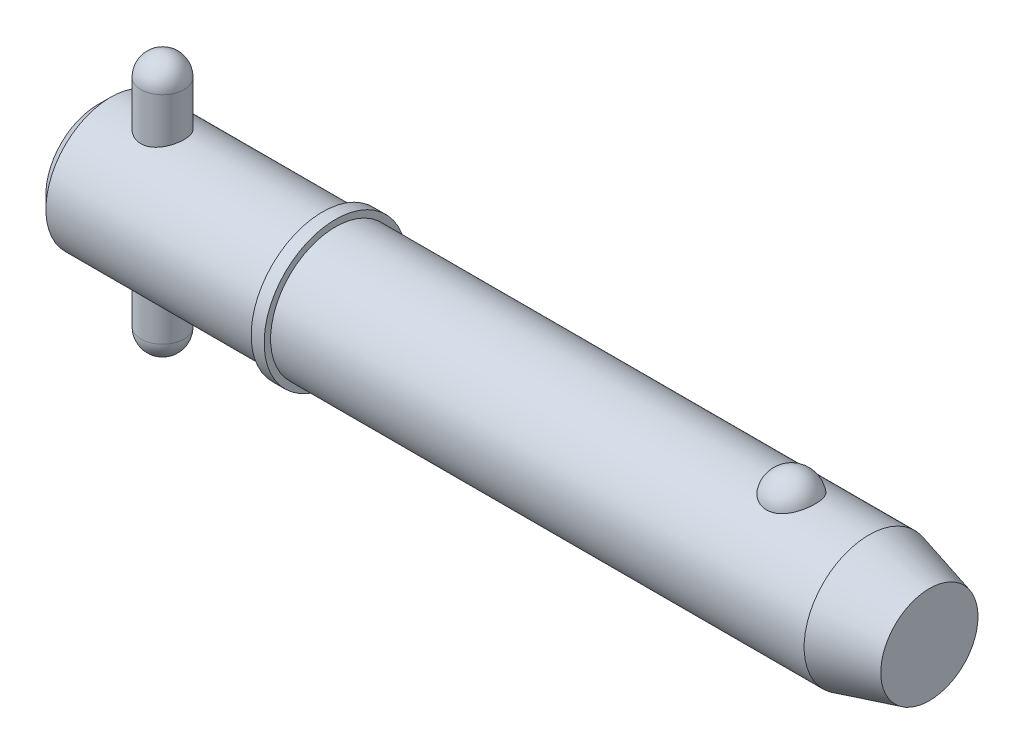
ISO-10303-21;
HEADER;
FILE_DESCRIPTION(('STEP AP214'),'2;1');
FILE_NAME('part.step','',(''),(''),'','','');
FILE_SCHEMA(('AUTOMOTIVE_DESIGN { 1 0 10303 214 1 1 1 1 }'));
ENDSEC;
DATA;
#1=APPLICATION_CONTEXT('core data for automotive mechanical design processes');
#2=APPLICATION_PROTOCOL_DEFINITION('international standard','automotive_design',2000,#1);
#3=PRODUCT_CONTEXT('',#1,'mechanical');
#4=PRODUCT('Part','Part','',(#3));
#5=PRODUCT_RELATED_PRODUCT_CATEGORY('part','',(#4));
#6=PRODUCT_DEFINITION_FORMATION('','',#4);
#7=PRODUCT_DEFINITION_CONTEXT('part definition',#1,'design');
#8=PRODUCT_DEFINITION('design','',#6,#7);
#9=PRODUCT_DEFINITION_SHAPE('','',#8);
#10=(LENGTH_UNIT() NAMED_UNIT(*) SI_UNIT(.MILLI.,.METRE.));
#11=(NAMED_UNIT(*) PLANE_ANGLE_UNIT() SI_UNIT($,.RADIAN.));
#12=(NAMED_UNIT(*) SI_UNIT($,.STERADIAN.) SOLID_ANGLE_UNIT());
#13=UNCERTAINTY_MEASURE_WITH_UNIT(LENGTH_MEASURE(1.E-05),#10,'distance_accuracy_value','');
#14=(GEOMETRIC_REPRESENTATION_CONTEXT(3) GLOBAL_UNCERTAINTY_ASSIGNED_CONTEXT((#13)) GLOBAL_UNIT_ASSIGNED_CONTEXT((#10,
#11,#12)) REPRESENTATION_CONTEXT('',''));
#15=CARTESIAN_POINT('',(0.,0.,0.));
#16=DIRECTION('',(0.,0.,1.));
#17=DIRECTION('',(1.,0.,0.));
#18=AXIS2_PLACEMENT_3D('',#15,#16,#17);
#19=CARTESIAN_POINT('',(9.525,19.05,0.));
#20=DIRECTION('',(0.,-1.,0.));
#21=DIRECTION('',(0.,0.,-1.));
#22=AXIS2_PLACEMENT_3D('',#19,#20,#21);
#23=CYLINDRICAL_SURFACE('',#22,3.175);
#24=CARTESIAN_POINT('',(9.525,-15.875,0.));
#25=DIRECTION('',(0.,-1.,0.));
#26=DIRECTION('',(0.,0.,-1.));
#27=AXIS2_PLACEMENT_3D('',#24,#25,#26);
#28=CIRCLE('',#27,3.175);
#29=CARTESIAN_POINT('',(9.525,-15.875,-3.175));
#30=VERTEX_POINT('',#29);
#31=EDGE_CURVE('P0_E10',#30,#30,#28,.F.);
#32=CARTESIAN_POINT('',(9.525,15.875,0.));
#33=DIRECTION('',(0.,-1.,0.));
#34=DIRECTION('',(0.,0.,-1.));
#35=AXIS2_PLACEMENT_3D('',#32,#33,#34);
#36=CIRCLE('',#35,3.175);
#37=CARTESIAN_POINT('',(9.525,15.875,-3.175));
#38=VERTEX_POINT('',#37);
#39=EDGE_CURVE('P0_E21',#38,#38,#36,.T.);
#40=CARTESIAN_POINT('',(9.525,-15.875,-3.175));
#41=CARTESIAN_POINT('',(9.525,-15.5442708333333,-3.175));
#42=CARTESIAN_POINT('',(9.525,-15.2135416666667,-3.175));
#43=CARTESIAN_POINT('',(9.525,-14.5520833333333,-3.175));
#44=CARTESIAN_POINT('',(9.525,-14.2213541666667,-3.175));
#45=CARTESIAN_POINT('',(9.525,-13.5598958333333,-3.175));
#46=CARTESIAN_POINT('',(9.525,-13.2291666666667,-3.175));
#47=CARTESIAN_POINT('',(9.525,-12.5677083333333,-3.175));
#48=CARTESIAN_POINT('',(9.525,-12.2369791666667,-3.175));
#49=CARTESIAN_POINT('',(9.525,-11.5755208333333,-3.175));
#50=CARTESIAN_POINT('',(9.525,-11.2447916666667,-3.175));
#51=CARTESIAN_POINT('',(9.525,-10.5833333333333,-3.175));
#52=CARTESIAN_POINT('',(9.525,-10.2526041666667,-3.175));
#53=CARTESIAN_POINT('',(9.525,-9.59114583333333,-3.175));
#54=CARTESIAN_POINT('',(9.525,-9.26041666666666,-3.175));
#55=CARTESIAN_POINT('',(9.525,-8.59895833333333,-3.175));
#56=CARTESIAN_POINT('',(9.525,-8.26822916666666,-3.175));
#57=CARTESIAN_POINT('',(9.525,-7.60677083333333,-3.175));
#58=CARTESIAN_POINT('',(9.525,-7.27604166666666,-3.175));
#59=CARTESIAN_POINT('',(9.525,-6.61458333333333,-3.175));
#60=CARTESIAN_POINT('',(9.525,-6.28385416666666,-3.175));
#61=CARTESIAN_POINT('',(9.525,-5.62239583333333,-3.175));
#62=CARTESIAN_POINT('',(9.525,-5.29166666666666,-3.175));
#63=CARTESIAN_POINT('',(9.525,-4.63020833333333,-3.175));
#64=CARTESIAN_POINT('',(9.525,-4.29947916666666,-3.175));
#65=CARTESIAN_POINT('',(9.525,-3.63802083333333,-3.175));
#66=CARTESIAN_POINT('',(9.525,-3.30729166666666,-3.175));
#67=CARTESIAN_POINT('',(9.525,-2.64583333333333,-3.175));
#68=CARTESIAN_POINT('',(9.525,-2.31510416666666,-3.175));
#69=CARTESIAN_POINT('',(9.525,-1.65364583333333,-3.175));
#70=CARTESIAN_POINT('',(9.525,-1.32291666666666,-3.175));
#71=CARTESIAN_POINT('',(9.525,-0.661458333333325,-3.175));
#72=CARTESIAN_POINT('',(9.525,-0.330729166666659,-3.175));
#73=CARTESIAN_POINT('',(9.525,0.330729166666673,-3.175));
#74=CARTESIAN_POINT('',(9.525,0.661458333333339,-3.175));
#75=CARTESIAN_POINT('',(9.525,1.32291666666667,-3.175));
#76=CARTESIAN_POINT('',(9.525,1.65364583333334,-3.175));
#77=CARTESIAN_POINT('',(9.525,2.31510416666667,-3.175));
#78=CARTESIAN_POINT('',(9.525,2.64583333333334,-3.175));
#79=CARTESIAN_POINT('',(9.525,3.30729166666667,-3.175));
#80=CARTESIAN_POINT('',(9.525,3.63802083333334,-3.175));
#81=CARTESIAN_POINT('',(9.525,4.29947916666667,-3.175));
#82=CARTESIAN_POINT('',(9.525,4.63020833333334,-3.175));
#83=CARTESIAN_POINT('',(9.525,5.29166666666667,-3.175));
#84=CARTESIAN_POINT('',(9.525,5.62239583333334,-3.175));
#85=CARTESIAN_POINT('',(9.525,6.28385416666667,-3.175));
#86=CARTESIAN_POINT('',(9.525,6.61458333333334,-3.175));
#87=CARTESIAN_POINT('',(9.525,7.27604166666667,-3.175));
#88=CARTESIAN_POINT('',(9.525,7.60677083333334,-3.175));
#89=CARTESIAN_POINT('',(9.525,8.26822916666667,-3.175));
#90=CARTESIAN_POINT('',(9.525,8.59895833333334,-3.175));
#91=CARTESIAN_POINT('',(9.525,9.26041666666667,-3.175));
#92=CARTESIAN_POINT('',(9.525,9.59114583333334,-3.175));
#93=CARTESIAN_POINT('',(9.525,10.2526041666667,-3.175));
#94=CARTESIAN_POINT('',(9.525,10.5833333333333,-3.175));
#95=CARTESIAN_POINT('',(9.525,11.2447916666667,-3.175));
#96=CARTESIAN_POINT('',(9.525,11.5755208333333,-3.175));
#97=CARTESIAN_POINT('',(9.525,12.2369791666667,-3.175));
#98=CARTESIAN_POINT('',(9.525,12.5677083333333,-3.175));
#99=CARTESIAN_POINT('',(9.525,13.2291666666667,-3.175));
#100=CARTESIAN_POINT('',(9.525,13.5598958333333,-3.175));
#101=CARTESIAN_POINT('',(9.525,14.2213541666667,-3.175));
#102=CARTESIAN_POINT('',(9.525,14.5520833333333,-3.175));
#103=CARTESIAN_POINT('',(9.525,15.2135416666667,-3.175));
#104=CARTESIAN_POINT('',(9.525,15.5442708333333,-3.175));
#105=CARTESIAN_POINT('',(9.525,15.875,-3.175));
#106=B_SPLINE_CURVE_WITH_KNOTS('',3,(#40,#41,#42,#43,#44,#45,#46,#47,#48,#49,#50,#51,#52,#53,
#54,#55,#56,#57,#58,#59,#60,#61,#62,#63,#64,#65,#66,#67,#68,#69,#70,#71,#72,#73,#74,#75,#76,#77,
#78,#79,#80,#81,#82,#83,#84,#85,#86,#87,#88,#89,#90,#91,#92,#93,#94,#95,#96,#97,#98,#99,#100,
#101,#102,#103,#104,#105),.UNSPECIFIED.,.F.,.F.,(4,2,2,2,2,2,2,2,2,2,2,2,2,2,2,2,2,2,2,2,2,2,2,
2,2,2,2,2,2,2,2,2,4),(0.,0.992187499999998,1.984375,2.9765625,3.96875,4.96093749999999,5.953125,
6.9453125,7.9375,8.92968749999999,9.921875,10.9140625,11.90625,12.8984375,13.890625,14.8828125,
15.875,16.8671875,17.859375,18.8515625,19.84375,20.8359375,21.828125,22.8203125,23.8125,
24.8046875,25.796875,26.7890625,27.78125,28.7734375,29.765625,30.7578125,31.75),.UNSPECIFIED.);
#107=EDGE_CURVE('P0_BSEAM14',#30,#38,#106,.T.);
#108=ORIENTED_EDGE('',*,*,#31,.T.);
#109=ORIENTED_EDGE('',*,*,#39,.T.);
#110=ORIENTED_EDGE('',*,*,#107,.T.);
#111=ORIENTED_EDGE('',*,*,#107,.F.);
#112=EDGE_LOOP('',(#108,#110,#109,#111));
#113=FACE_BOUND('',#112,.T.);
#114=ADVANCED_FACE('P0_F14',(#113),#23,.T.);
#115=CARTESIAN_POINT('',(9.525,-15.875,0.));
#116=DIRECTION('',(0.,0.,1.));
#117=DIRECTION('',(1.,0.,0.));
#118=AXIS2_PLACEMENT_3D('',#115,#116,#117);
#119=SPHERICAL_SURFACE('',#118,3.175);
#120=CARTESIAN_POINT('',(9.525,-15.875,0.));
#121=DIRECTION('',(0.,-1.,0.));
#122=DIRECTION('',(0.,0.,-1.));
#123=AXIS2_PLACEMENT_3D('',#120,#121,#122);
#124=SPHERICAL_SURFACE('',#123,3.175);
#125=ORIENTED_EDGE('',*,*,#31,.F.);
#126=EDGE_LOOP('',(#125));
#127=FACE_BOUND('',#126,.T.);
#128=ADVANCED_FACE('P0_F29',(#127),#124,.T.);
#129=CARTESIAN_POINT('',(9.525,15.875,0.));
#130=DIRECTION('',(0.,0.,1.));
#131=DIRECTION('',(1.,0.,0.));
#132=AXIS2_PLACEMENT_3D('',#129,#130,#131);
#133=SPHERICAL_SURFACE('',#132,3.175);
#134=CARTESIAN_POINT('',(9.525,15.875,0.));
#135=DIRECTION('',(0.,-1.,0.));
#136=DIRECTION('',(0.,0.,-1.));
#137=AXIS2_PLACEMENT_3D('',#134,#135,#136);
#138=SPHERICAL_SURFACE('',#137,3.175);
#139=ORIENTED_EDGE('',*,*,#39,.F.);
#140=EDGE_LOOP('',(#139));
#141=FACE_BOUND('',#140,.T.);
#142=ADVANCED_FACE('P0_F16',(#141),#138,.T.);
#143=CLOSED_SHELL('',(#114,#128,#142));
#144=MANIFOLD_SOLID_BREP('P0_B1',#143);
#145=CARTESIAN_POINT('',(0.,0.,0.));
#146=DIRECTION('',(1.,0.,0.));
#147=DIRECTION('',(0.,0.,-1.));
#148=AXIS2_PLACEMENT_3D('',#145,#146,#147);
#149=CYLINDRICAL_SURFACE('',#148,9.525);
#150=CARTESIAN_POINT('',(113.343054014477,0.,0.));
#151=DIRECTION('',(1.,0.,0.));
#152=DIRECTION('',(0.,0.,-1.));
#153=AXIS2_PLACEMENT_3D('',#150,#151,#152);
#154=CIRCLE('',#153,9.525);
#155=CARTESIAN_POINT('',(113.343054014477,0.,-9.525));
#156=VERTEX_POINT('',#155);
#157=EDGE_CURVE('P1_E81',#156,#156,#154,.T.);
#158=ORIENTED_EDGE('',*,*,#157,.F.);
#159=EDGE_LOOP('',(#158));
#160=FACE_BOUND('',#159,.T.);
#161=CARTESIAN_POINT('',(34.93,0.,0.));
#162=DIRECTION('',(1.,0.,0.));
#163=DIRECTION('',(0.,0.,-1.));
#164=AXIS2_PLACEMENT_3D('',#161,#162,#163);
#165=CIRCLE('',#164,9.525);
#166=CARTESIAN_POINT('',(34.93,0.,-9.525));
#167=VERTEX_POINT('',#166);
#168=EDGE_CURVE('P1_E85',#167,#167,#165,.T.);
#169=ORIENTED_EDGE('',*,*,#168,.T.);
#170=EDGE_LOOP('',(#169));
#171=FACE_BOUND('',#170,.T.);
#172=CARTESIAN_POINT('',(101.945757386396,8.80405803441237,3.63513233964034));
#173=CARTESIAN_POINT('',(101.851676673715,8.80405953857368,3.63513053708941));
#174=CARTESIAN_POINT('',(101.757561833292,8.80561325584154,3.63137461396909));
#175=CARTESIAN_POINT('',(101.570012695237,8.81177748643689,3.61638665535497));
#176=CARTESIAN_POINT('',(101.476578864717,8.81638992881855,3.60514990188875));
#177=CARTESIAN_POINT('',(101.197945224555,8.83467114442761,3.56024627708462));
#178=CARTESIAN_POINT('',(101.014691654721,8.85278327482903,3.5153862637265));
#179=CARTESIAN_POINT('',(100.659509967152,8.89871214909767,3.39742145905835));
#180=CARTESIAN_POINT('',(100.487553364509,8.92650327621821,3.32439116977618));
#181=CARTESIAN_POINT('',(100.158707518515,8.98874819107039,3.15220244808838));
#182=CARTESIAN_POINT('',(100.001811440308,9.02319893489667,3.05305594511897));
#183=CARTESIAN_POINT('',(99.7022147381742,9.09629186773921,2.82797815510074));
#184=CARTESIAN_POINT('',(99.5600600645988,9.13502685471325,2.70135138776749));
#185=CARTESIAN_POINT('',(99.2982999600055,9.2118657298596,2.42641932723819));
#186=CARTESIAN_POINT('',(99.1787015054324,9.2499694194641,2.27810735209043));
#187=CARTESIAN_POINT('',(98.959645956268,9.32341082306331,1.95652290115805));
#188=CARTESIAN_POINT('',(98.8613174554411,9.35855090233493,1.78243511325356));
#189=CARTESIAN_POINT('',(98.6938190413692,9.42045142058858,1.41937246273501));
#190=CARTESIAN_POINT('',(98.6246511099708,9.44721128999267,1.23039658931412));
#191=CARTESIAN_POINT('',(98.5161994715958,9.48990641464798,0.84037088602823));
#192=CARTESIAN_POINT('',(98.4772880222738,9.50570658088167,0.639202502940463));
#193=CARTESIAN_POINT('',(98.4315550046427,9.52433146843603,0.23266436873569));
#194=CARTESIAN_POINT('',(98.4247324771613,9.52715657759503,0.0272947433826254));
#195=CARTESIAN_POINT('',(98.443255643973,9.51956918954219,-0.380478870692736));
#196=CARTESIAN_POINT('',(98.4684052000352,9.50923740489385,-0.582893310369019));
#197=CARTESIAN_POINT('',(98.5500253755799,9.47651897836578,-0.980293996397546));
#198=CARTESIAN_POINT('',(98.6064966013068,9.45413210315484,-1.17528009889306));
#199=CARTESIAN_POINT('',(98.7497192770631,9.39954044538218,-1.55263697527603));
#200=CARTESIAN_POINT('',(98.8365124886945,9.36732213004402,-1.73498993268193));
#201=CARTESIAN_POINT('',(99.0386103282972,9.29640700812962,-2.08177763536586));
#202=CARTESIAN_POINT('',(99.1539172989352,9.25770966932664,-2.24621090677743));
#203=CARTESIAN_POINT('',(99.411264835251,9.17775604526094,-2.55338333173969));
#204=CARTESIAN_POINT('',(99.5534344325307,9.136488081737,-2.69601150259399));
#205=CARTESIAN_POINT('',(99.86089985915,9.05620497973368,-2.95451229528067));
#206=CARTESIAN_POINT('',(100.026193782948,9.01718965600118,-3.070387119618));
#207=CARTESIAN_POINT('',(100.372052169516,8.94680019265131,-3.26976836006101));
#208=CARTESIAN_POINT('',(100.552227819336,8.91528408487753,-3.353897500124));
#209=CARTESIAN_POINT('',(100.925651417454,8.86272514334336,-3.49043503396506));
#210=CARTESIAN_POINT('',(101.118894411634,8.84167836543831,-3.54285537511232));
#211=CARTESIAN_POINT('',(101.502503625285,8.81348056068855,-3.61241306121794));
#212=CARTESIAN_POINT('',(101.692525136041,8.80568348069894,-3.6311933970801));
#213=CARTESIAN_POINT('',(102.073190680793,8.80289410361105,-3.63795342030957));
#214=CARTESIAN_POINT('',(102.263834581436,8.80789922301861,-3.62593932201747));
#215=CARTESIAN_POINT('',(102.634007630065,8.82974915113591,-3.57238430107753));
#216=CARTESIAN_POINT('',(102.813697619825,8.84621463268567,-3.53178890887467));
#217=CARTESIAN_POINT('',(103.163422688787,8.88875330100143,-3.42331083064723));
#218=CARTESIAN_POINT('',(103.333456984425,8.91482726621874,-3.35542593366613));
#219=CARTESIAN_POINT('',(103.663237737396,8.97448239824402,-3.19248225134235));
#220=CARTESIAN_POINT('',(103.822680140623,9.00821446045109,-3.0968647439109));
#221=CARTESIAN_POINT('',(104.123513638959,9.07935398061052,-2.88162736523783));
#222=CARTESIAN_POINT('',(104.264900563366,9.11676228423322,-2.76200196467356));
#223=CARTESIAN_POINT('',(104.53331931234,9.19347419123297,-2.49516285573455));
#224=CARTESIAN_POINT('',(104.659275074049,9.23277872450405,-2.34686614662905));
#225=CARTESIAN_POINT('',(104.885522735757,9.3073761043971,-2.0309368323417));
#226=CARTESIAN_POINT('',(104.98581004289,9.34266823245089,-1.86330077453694));
#227=CARTESIAN_POINT('',(105.161514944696,9.40674710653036,-1.50744893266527));
#228=CARTESIAN_POINT('',(105.236041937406,9.43529176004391,-1.31874876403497));
#229=CARTESIAN_POINT('',(105.35416505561,9.48144132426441,-0.930631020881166));
#230=CARTESIAN_POINT('',(105.397760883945,9.49904612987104,-0.73121334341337));
#231=CARTESIAN_POINT('',(105.453158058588,9.5215314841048,-0.327147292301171));
#232=CARTESIAN_POINT('',(105.464935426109,9.52640243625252,-0.12249509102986));
#233=CARTESIAN_POINT('',(105.456382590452,9.5228957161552,0.286018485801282));
#234=CARTESIAN_POINT('',(105.43605305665,9.5145183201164,0.489879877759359));
#235=CARTESIAN_POINT('',(105.363884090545,9.48544083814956,0.889994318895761));
#236=CARTESIAN_POINT('',(105.312199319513,9.46480124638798,1.08627971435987));
#237=CARTESIAN_POINT('',(105.178491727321,9.41333895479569,1.46682086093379));
#238=CARTESIAN_POINT('',(105.096466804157,9.38251554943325,1.65107577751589));
#239=CARTESIAN_POINT('',(104.90319292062,9.31365636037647,2.00346348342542));
#240=CARTESIAN_POINT('',(104.791783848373,9.27558138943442,2.17150083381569));
#241=CARTESIAN_POINT('',(104.542294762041,9.19638714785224,2.48563115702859));
#242=CARTESIAN_POINT('',(104.404216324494,9.15526805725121,2.63172542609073));
#243=CARTESIAN_POINT('',(104.104843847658,9.07465393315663,2.89750997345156));
#244=CARTESIAN_POINT('',(103.943610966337,9.03515496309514,3.01726776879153));
#245=CARTESIAN_POINT('',(103.601613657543,8.96227564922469,3.22732920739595));
#246=CARTESIAN_POINT('',(103.420841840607,8.92889763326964,3.31762165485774));
#247=CARTESIAN_POINT('',(103.051445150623,8.8734538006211,3.46314419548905));
#248=CARTESIAN_POINT('',(102.86332371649,8.85102983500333,3.51950082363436));
#249=CARTESIAN_POINT('',(102.57578699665,8.8266696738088,3.57993683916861));
#250=CARTESIAN_POINT('',(102.479133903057,8.82009725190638,3.5960621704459));
#251=CARTESIAN_POINT('',(102.284677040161,8.81020897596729,3.62022512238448));
#252=CARTESIAN_POINT('',(102.18687410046,8.80689090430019,3.62826825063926));
#253=CARTESIAN_POINT('',(102.041224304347,8.80445615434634,3.63416760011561));
#254=CARTESIAN_POINT('',(101.993495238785,8.80405727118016,3.63513325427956));
#255=CARTESIAN_POINT('',(101.945757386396,8.80405803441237,3.63513233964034));
#256=B_SPLINE_CURVE_WITH_KNOTS('',3,(#172,#173,#174,#175,#176,#177,#178,#179,#180,#181,#182,
#183,#184,#185,#186,#187,#188,#189,#190,#191,#192,#193,#194,#195,#196,#197,#198,#199,#200,#201,
#202,#203,#204,#205,#206,#207,#208,#209,#210,#211,#212,#213,#214,#215,#216,#217,#218,#219,#220,
#221,#222,#223,#224,#225,#226,#227,#228,#229,#230,#231,#232,#233,#234,#235,#236,#237,#238,#239,
#240,#241,#242,#243,#244,#245,#246,#247,#248,#249,#250,#251,#252,#253,#254,#255),.UNSPECIFIED.,
.T.,.F.,(4,2,2,2,2,2,2,2,2,2,2,2,2,2,2,2,2,2,2,2,2,2,2,2,2,2,2,2,2,2,2,2,2,2,2,2,2,2,2,2,2,4),
(0.,0.282202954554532,0.564584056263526,1.13017050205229,1.69427128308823,2.25811483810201,
2.83836627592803,3.4187968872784,4.02497117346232,4.63118665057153,5.24474754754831,
5.85829010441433,6.46808687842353,7.07789545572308,7.68854723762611,8.29924920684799,
8.91296283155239,9.52662591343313,10.1275338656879,10.7282152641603,11.2986646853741,
11.8689989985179,12.4213015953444,12.973648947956,13.5380053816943,14.1024919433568,
14.695298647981,15.2882113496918,15.8999469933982,16.5116885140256,17.1238909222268,
17.7360805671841,18.3452748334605,18.9545113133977,19.567138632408,20.179729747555,
20.7907316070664,21.4019653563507,21.9915938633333,22.2859053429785,22.5800161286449,
22.7232098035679),.UNSPECIFIED.);
#257=CARTESIAN_POINT('',(101.945757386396,8.80405803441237,3.63513233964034));
#258=VERTEX_POINT('',#257);
#259=EDGE_CURVE('P1_E35',#258,#258,#256,.T.);
#260=ORIENTED_EDGE('',*,*,#259,.T.);
#261=EDGE_LOOP('',(#260));
#262=FACE_BOUND('',#261,.T.);
#263=ADVANCED_FACE('P1_F13',(#160,#171,#262),#149,.T.);
#264=CARTESIAN_POINT('',(0.,0.,0.));
#265=DIRECTION('',(-1.,0.,0.));
#266=DIRECTION('',(0.,0.,1.));
#267=AXIS2_PLACEMENT_3D('',#264,#265,#266);
#268=PLANE('',#267);
#269=CARTESIAN_POINT('',(0.,0.,0.));
#270=DIRECTION('',(1.,0.,0.));
#271=DIRECTION('',(0.,0.,-1.));
#272=AXIS2_PLACEMENT_3D('',#269,#270,#271);
#273=CIRCLE('',#272,7.62);
#274=CARTESIAN_POINT('',(0.,0.,-7.62));
#275=VERTEX_POINT('',#274);
#276=EDGE_CURVE('P1_E9',#275,#275,#273,.T.);
#277=ORIENTED_EDGE('',*,*,#276,.F.);
#278=EDGE_LOOP('',(#277));
#279=FACE_BOUND('',#278,.T.);
#280=ADVANCED_FACE('P1_F15',(#279),#268,.T.);
#281=CARTESIAN_POINT('',(1.90499999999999,0.,0.));
#282=DIRECTION('',(1.,0.,0.));
#283=DIRECTION('',(0.,0.,-1.));
#284=AXIS2_PLACEMENT_3D('',#281,#282,#283);
#285=CONICAL_SURFACE('',#284,9.525,0.785398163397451);
#286=ORIENTED_EDGE('',*,*,#276,.T.);
#287=EDGE_LOOP('',(#286));
#288=FACE_BOUND('',#287,.T.);
#289=CARTESIAN_POINT('',(1.90499999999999,0.,0.));
#290=DIRECTION('',(1.,0.,0.));
#291=DIRECTION('',(0.,0.,-1.));
#292=AXIS2_PLACEMENT_3D('',#289,#290,#291);
#293=CIRCLE('',#292,9.525);
#294=CARTESIAN_POINT('',(1.90499999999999,0.,-9.525));
#295=VERTEX_POINT('',#294);
#296=EDGE_CURVE('P1_E26',#295,#295,#293,.T.);
#297=ORIENTED_EDGE('',*,*,#296,.F.);
#298=EDGE_LOOP('',(#297));
#299=FACE_BOUND('',#298,.T.);
#300=ADVANCED_FACE('P1_F77',(#288,#299),#285,.T.);
#301=CARTESIAN_POINT('',(0.,0.,0.));
#302=DIRECTION('',(1.,0.,0.));
#303=DIRECTION('',(0.,0.,-1.));
#304=AXIS2_PLACEMENT_3D('',#301,#302,#303);
#305=CYLINDRICAL_SURFACE('',#304,9.525);
#306=CARTESIAN_POINT('',(9.525,-8.98025612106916,3.175));
#307=CARTESIAN_POINT('',(9.35206354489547,-8.98025555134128,3.17500081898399));
#308=CARTESIAN_POINT('',(9.17913201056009,-8.98530617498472,3.16082293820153));
#309=CARTESIAN_POINT('',(8.83839221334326,-9.00485797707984,3.10467734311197));
#310=CARTESIAN_POINT('',(8.67058479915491,-9.0193607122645,3.06270505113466));
#311=CARTESIAN_POINT('',(8.34508461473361,-9.05599546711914,2.95260866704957));
#312=CARTESIAN_POINT('',(8.18737272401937,-9.07811252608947,2.88453582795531));
#313=CARTESIAN_POINT('',(7.88555684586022,-9.12746212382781,2.72434567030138));
#314=CARTESIAN_POINT('',(7.74145587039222,-9.1546957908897,2.63222304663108));
#315=CARTESIAN_POINT('',(7.46531411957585,-9.21240503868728,2.42268738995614));
#316=CARTESIAN_POINT('',(7.33388351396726,-9.24296141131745,2.30449228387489));
#317=CARTESIAN_POINT('',(7.09229340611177,-9.30319020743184,2.0478358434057));
#318=CARTESIAN_POINT('',(6.98213731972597,-9.33286248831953,1.90937126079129));
#319=CARTESIAN_POINT('',(6.78345450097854,-9.38891527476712,1.61164431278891));
#320=CARTESIAN_POINT('',(6.69556709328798,-9.41518969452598,1.45193356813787));
#321=CARTESIAN_POINT('',(6.54814671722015,-9.46053437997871,1.11896913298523));
#322=CARTESIAN_POINT('',(6.48860610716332,-9.47960658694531,0.945719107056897));
#323=CARTESIAN_POINT('',(6.40163866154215,-9.50782564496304,0.596991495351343));
#324=CARTESIAN_POINT('',(6.373166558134,-9.5172947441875,0.421801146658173));
#325=CARTESIAN_POINT('',(6.3458207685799,-9.52638456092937,0.068890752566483));
#326=CARTESIAN_POINT('',(6.34693945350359,-9.52600781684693,-0.108828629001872));
#327=CARTESIAN_POINT('',(6.37808050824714,-9.51566675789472,-0.454353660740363));
#328=CARTESIAN_POINT('',(6.4069675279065,-9.50607905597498,-0.622274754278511));
#329=CARTESIAN_POINT('',(6.490947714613,-9.47886621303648,-0.950732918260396));
#330=CARTESIAN_POINT('',(6.54604265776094,-9.46124052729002,-1.11126948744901));
#331=CARTESIAN_POINT('',(6.68153768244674,-9.41945253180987,-1.42288410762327));
#332=CARTESIAN_POINT('',(6.76226085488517,-9.3952073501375,-1.57381010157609));
#333=CARTESIAN_POINT('',(6.94645456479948,-9.34270397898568,-1.86030973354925));
#334=CARTESIAN_POINT('',(7.04993142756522,-9.31444467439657,-1.99587908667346));
#335=CARTESIAN_POINT('',(7.28241619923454,-9.25532159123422,-2.2545702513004));
#336=CARTESIAN_POINT('',(7.4123967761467,-9.22439783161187,-2.37680549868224));
#337=CARTESIAN_POINT('',(7.69127470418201,-9.1645528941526,-2.5980302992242));
#338=CARTESIAN_POINT('',(7.84017496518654,-9.13563202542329,-2.6970162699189));
#339=CARTESIAN_POINT('',(8.15547526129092,-9.08273917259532,-2.87016016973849));
#340=CARTESIAN_POINT('',(8.32209451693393,-9.05884361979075,-2.94394402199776));
#341=CARTESIAN_POINT('',(8.66638917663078,-9.01959241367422,-3.06210713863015));
#342=CARTESIAN_POINT('',(8.84405991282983,-9.00423318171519,-3.10649872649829));
#343=CARTESIAN_POINT('',(9.19682677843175,-8.98460345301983,-3.16281207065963));
#344=CARTESIAN_POINT('',(9.37167742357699,-8.9798639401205,-3.17610837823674));
#345=CARTESIAN_POINT('',(9.72113927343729,-8.9806993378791,-3.17374726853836));
#346=CARTESIAN_POINT('',(9.89575051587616,-8.98627237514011,-3.15809511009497));
#347=CARTESIAN_POINT('',(10.2335233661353,-9.00663737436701,-3.09951644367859));
#348=CARTESIAN_POINT('',(10.3968722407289,-9.02110608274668,-3.05754530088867));
#349=CARTESIAN_POINT('',(10.7141759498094,-9.05727657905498,-2.94866651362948));
#350=CARTESIAN_POINT('',(10.8681291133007,-9.07897964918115,-2.88175444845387));
#351=CARTESIAN_POINT('',(11.1676828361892,-9.12802586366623,-2.72248103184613));
#352=CARTESIAN_POINT('',(11.3128635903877,-9.1555260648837,-2.62937980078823));
#353=CARTESIAN_POINT('',(11.5860387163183,-9.21276315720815,-2.42120937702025));
#354=CARTESIAN_POINT('',(11.7140280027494,-9.24250070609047,-2.30613370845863));
#355=CARTESIAN_POINT('',(11.9555513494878,-9.30259247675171,-2.05070616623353));
#356=CARTESIAN_POINT('',(12.0680936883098,-9.33290753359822,-1.90940458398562));
#357=CARTESIAN_POINT('',(12.267933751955,-9.3893275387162,-1.60917665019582));
#358=CARTESIAN_POINT('',(12.3552323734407,-9.41543263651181,-1.45025092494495));
#359=CARTESIAN_POINT('',(12.5013088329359,-9.46036988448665,-1.12007606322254));
#360=CARTESIAN_POINT('',(12.5602723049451,-9.47924920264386,-0.9489158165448));
#361=CARTESIAN_POINT('',(12.6483355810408,-9.50781089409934,-0.598355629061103));
#362=CARTESIAN_POINT('',(12.6774461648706,-9.5174965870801,-0.4189586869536));
#363=CARTESIAN_POINT('',(12.7040070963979,-9.52632915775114,-0.066088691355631));
#364=CARTESIAN_POINT('',(12.7028811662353,-9.52594996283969,0.107266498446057));
#365=CARTESIAN_POINT('',(12.6725130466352,-9.51586223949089,0.451202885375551));
#366=CARTESIAN_POINT('',(12.643273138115,-9.50615446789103,0.621784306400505));
#367=CARTESIAN_POINT('',(12.5584514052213,-9.47867404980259,0.952633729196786));
#368=CARTESIAN_POINT('',(12.5032953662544,-9.46103195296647,1.1130225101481));
#369=CARTESIAN_POINT('',(12.3686013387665,-9.41949985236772,1.42233126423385));
#370=CARTESIAN_POINT('',(12.2890589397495,-9.39560871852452,1.57124915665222));
#371=CARTESIAN_POINT('',(12.1044667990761,-9.34294133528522,1.85938800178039));
#372=CARTESIAN_POINT('',(11.9985831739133,-9.31401720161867,1.9980473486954));
#373=CARTESIAN_POINT('',(11.7657327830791,-9.25490239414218,2.25609475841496));
#374=CARTESIAN_POINT('',(11.6387592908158,-9.22471131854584,2.37547664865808));
#375=CARTESIAN_POINT('',(11.3613902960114,-9.16505913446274,2.59633024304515));
#376=CARTESIAN_POINT('',(11.2102725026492,-9.13567286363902,2.69691791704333));
#377=CARTESIAN_POINT('',(10.8923631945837,-9.08241113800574,2.87119803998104));
#378=CARTESIAN_POINT('',(10.7255757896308,-9.05853424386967,2.94489751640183));
#379=CARTESIAN_POINT('',(10.3887212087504,-9.02021736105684,3.06020415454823));
#380=CARTESIAN_POINT('',(10.219143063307,-9.00539959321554,3.10311136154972));
#381=CARTESIAN_POINT('',(9.87470703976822,-8.98542092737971,3.16050396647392));
#382=CARTESIAN_POINT('',(9.699851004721,-8.98025669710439,3.17499917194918));
#383=CARTESIAN_POINT('',(9.525,-8.98025612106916,3.175));
#384=B_SPLINE_CURVE_WITH_KNOTS('',3,(#306,#307,#308,#309,#310,#311,#312,#313,#314,#315,#316,
#317,#318,#319,#320,#321,#322,#323,#324,#325,#326,#327,#328,#329,#330,#331,#332,#333,#334,#335,
#336,#337,#338,#339,#340,#341,#342,#343,#344,#345,#346,#347,#348,#349,#350,#351,#352,#353,#354,
#355,#356,#357,#358,#359,#360,#361,#362,#363,#364,#365,#366,#367,#368,#369,#370,#371,#372,#373,
#374,#375,#376,#377,#378,#379,#380,#381,#382,#383),.UNSPECIFIED.,.T.,.F.,(4,2,2,2,2,2,2,2,2,2,2,
2,2,2,2,2,2,2,2,2,2,2,2,2,2,2,2,2,2,2,2,2,2,2,2,2,2,2,4),(0.,0.518161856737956,1.03640907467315,
1.55364379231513,2.07099270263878,2.60671746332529,3.14252816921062,3.69231882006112,
4.24196117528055,4.77247962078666,5.30286129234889,5.81244090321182,6.32205505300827,
6.83836754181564,7.3548237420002,7.89559553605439,8.43645060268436,8.98501631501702,
9.53335188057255,10.056948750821,10.5804505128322,11.0859695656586,11.5915782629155,
12.1132237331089,12.6350231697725,13.1819271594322,13.7288117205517,14.2720628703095,
14.815117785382,15.3326491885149,15.8501386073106,16.3594083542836,16.868770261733,
17.3969527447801,17.925304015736,18.4743376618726,19.023227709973,19.5473069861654,
20.0712053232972),.UNSPECIFIED.);
#385=CARTESIAN_POINT('',(9.525,-8.98025612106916,3.175));
#386=VERTEX_POINT('',#385);
#387=EDGE_CURVE('P1_E17',#386,#386,#384,.T.);
#388=ORIENTED_EDGE('',*,*,#387,.F.);
#389=EDGE_LOOP('',(#388));
#390=FACE_BOUND('',#389,.T.);
#391=CARTESIAN_POINT('',(9.525,8.98025612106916,3.175));
#392=CARTESIAN_POINT('',(9.69793645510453,8.98025555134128,3.17500081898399));
#393=CARTESIAN_POINT('',(9.87086798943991,8.98530617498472,3.16082293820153));
#394=CARTESIAN_POINT('',(10.2116077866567,9.00485797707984,3.10467734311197));
#395=CARTESIAN_POINT('',(10.3794152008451,9.0193607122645,3.06270505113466));
#396=CARTESIAN_POINT('',(10.7049153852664,9.05599546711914,2.95260866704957));
#397=CARTESIAN_POINT('',(10.8626272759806,9.07811252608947,2.88453582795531));
#398=CARTESIAN_POINT('',(11.1644431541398,9.12746212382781,2.72434567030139));
#399=CARTESIAN_POINT('',(11.3085441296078,9.15469579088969,2.63222304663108));
#400=CARTESIAN_POINT('',(11.5846858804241,9.21240503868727,2.42268738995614));
#401=CARTESIAN_POINT('',(11.7161164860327,9.24296141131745,2.30449228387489));
#402=CARTESIAN_POINT('',(11.9577065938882,9.30319020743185,2.0478358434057));
#403=CARTESIAN_POINT('',(12.067862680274,9.33286248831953,1.90937126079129));
#404=CARTESIAN_POINT('',(12.2665454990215,9.38891527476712,1.61164431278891));
#405=CARTESIAN_POINT('',(12.354432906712,9.41518969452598,1.45193356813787));
#406=CARTESIAN_POINT('',(12.5018532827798,9.46053437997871,1.11896913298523));
#407=CARTESIAN_POINT('',(12.5613938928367,9.47960658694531,0.945719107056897));
#408=CARTESIAN_POINT('',(12.6483613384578,9.50782564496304,0.596991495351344));
#409=CARTESIAN_POINT('',(12.676833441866,9.5172947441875,0.421801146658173));
#410=CARTESIAN_POINT('',(12.7041792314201,9.52638456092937,0.0688907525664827));
#411=CARTESIAN_POINT('',(12.7030605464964,9.52600781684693,-0.108828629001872));
#412=CARTESIAN_POINT('',(12.6719194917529,9.51566675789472,-0.454353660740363));
#413=CARTESIAN_POINT('',(12.6430324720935,9.50607905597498,-0.622274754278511));
#414=CARTESIAN_POINT('',(12.559052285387,9.47886621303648,-0.950732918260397));
#415=CARTESIAN_POINT('',(12.5039573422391,9.46124052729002,-1.11126948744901));
#416=CARTESIAN_POINT('',(12.3684623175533,9.41945253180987,-1.42288410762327));
#417=CARTESIAN_POINT('',(12.2877391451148,9.3952073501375,-1.57381010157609));
#418=CARTESIAN_POINT('',(12.1035454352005,9.34270397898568,-1.86030973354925));
#419=CARTESIAN_POINT('',(12.0000685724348,9.31444467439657,-1.99587908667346));
#420=CARTESIAN_POINT('',(11.7675838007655,9.25532159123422,-2.2545702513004));
#421=CARTESIAN_POINT('',(11.6376032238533,9.22439783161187,-2.37680549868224));
#422=CARTESIAN_POINT('',(11.358725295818,9.1645528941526,-2.5980302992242));
#423=CARTESIAN_POINT('',(11.2098250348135,9.13563202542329,-2.6970162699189));
#424=CARTESIAN_POINT('',(10.8945247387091,9.08273917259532,-2.87016016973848));
#425=CARTESIAN_POINT('',(10.7279054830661,9.05884361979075,-2.94394402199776));
#426=CARTESIAN_POINT('',(10.3836108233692,9.01959241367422,-3.06210713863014));
#427=CARTESIAN_POINT('',(10.2059400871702,9.00423318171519,-3.10649872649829));
#428=CARTESIAN_POINT('',(9.85317322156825,8.98460345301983,-3.16281207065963));
#429=CARTESIAN_POINT('',(9.67832257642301,8.9798639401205,-3.17610837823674));
#430=CARTESIAN_POINT('',(9.32886072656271,8.9806993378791,-3.17374726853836));
#431=CARTESIAN_POINT('',(9.15424948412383,8.98627237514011,-3.15809511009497));
#432=CARTESIAN_POINT('',(8.81647663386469,9.00663737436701,-3.09951644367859));
#433=CARTESIAN_POINT('',(8.65312775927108,9.02110608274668,-3.05754530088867));
#434=CARTESIAN_POINT('',(8.33582405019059,9.05727657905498,-2.94866651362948));
#435=CARTESIAN_POINT('',(8.18187088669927,9.07897964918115,-2.88175444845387));
#436=CARTESIAN_POINT('',(7.88231716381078,9.12802586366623,-2.72248103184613));
#437=CARTESIAN_POINT('',(7.73713640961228,9.1555260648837,-2.62937980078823));
#438=CARTESIAN_POINT('',(7.46396128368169,9.21276315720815,-2.42120937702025));
#439=CARTESIAN_POINT('',(7.33597199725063,9.24250070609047,-2.30613370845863));
#440=CARTESIAN_POINT('',(7.09444865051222,9.30259247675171,-2.05070616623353));
#441=CARTESIAN_POINT('',(6.98190631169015,9.33290753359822,-1.90940458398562));
#442=CARTESIAN_POINT('',(6.78206624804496,9.3893275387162,-1.60917665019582));
#443=CARTESIAN_POINT('',(6.6947676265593,9.41543263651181,-1.45025092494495));
#444=CARTESIAN_POINT('',(6.54869116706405,9.46036988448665,-1.12007606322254));
#445=CARTESIAN_POINT('',(6.48972769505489,9.47924920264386,-0.948915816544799));
#446=CARTESIAN_POINT('',(6.40166441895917,9.50781089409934,-0.598355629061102));
#447=CARTESIAN_POINT('',(6.3725538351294,9.5174965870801,-0.418958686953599));
#448=CARTESIAN_POINT('',(6.34599290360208,9.52632915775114,-0.0660886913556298));
#449=CARTESIAN_POINT('',(6.3471188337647,9.52594996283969,0.107266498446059));
#450=CARTESIAN_POINT('',(6.37748695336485,9.51586223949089,0.451202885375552));
#451=CARTESIAN_POINT('',(6.40672686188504,9.50615446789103,0.621784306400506));
#452=CARTESIAN_POINT('',(6.49154859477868,9.47867404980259,0.952633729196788));
#453=CARTESIAN_POINT('',(6.54670463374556,9.46103195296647,1.11302251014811));
#454=CARTESIAN_POINT('',(6.68139866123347,9.41949985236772,1.42233126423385));
#455=CARTESIAN_POINT('',(6.76094106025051,9.39560871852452,1.57124915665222));
#456=CARTESIAN_POINT('',(6.94553320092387,9.34294133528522,1.85938800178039));
#457=CARTESIAN_POINT('',(7.05141682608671,9.31401720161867,1.9980473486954));
#458=CARTESIAN_POINT('',(7.28426721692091,9.25490239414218,2.25609475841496));
#459=CARTESIAN_POINT('',(7.41124070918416,9.22471131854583,2.37547664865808));
#460=CARTESIAN_POINT('',(7.68860970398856,9.16505913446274,2.59633024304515));
#461=CARTESIAN_POINT('',(7.83972749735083,9.13567286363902,2.69691791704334));
#462=CARTESIAN_POINT('',(8.15763680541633,9.08241113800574,2.87119803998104));
#463=CARTESIAN_POINT('',(8.32442421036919,9.05853424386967,2.94489751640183));
#464=CARTESIAN_POINT('',(8.66127879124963,9.02021736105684,3.06020415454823));
#465=CARTESIAN_POINT('',(8.83085693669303,9.00539959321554,3.10311136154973));
#466=CARTESIAN_POINT('',(9.17529296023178,8.98542092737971,3.16050396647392));
#467=CARTESIAN_POINT('',(9.350148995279,8.98025669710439,3.17499917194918));
#468=CARTESIAN_POINT('',(9.525,8.98025612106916,3.175));
#469=B_SPLINE_CURVE_WITH_KNOTS('',3,(#391,#392,#393,#394,#395,#396,#397,#398,#399,#400,#401,
#402,#403,#404,#405,#406,#407,#408,#409,#410,#411,#412,#413,#414,#415,#416,#417,#418,#419,#420,
#421,#422,#423,#424,#425,#426,#427,#428,#429,#430,#431,#432,#433,#434,#435,#436,#437,#438,#439,
#440,#441,#442,#443,#444,#445,#446,#447,#448,#449,#450,#451,#452,#453,#454,#455,#456,#457,#458,
#459,#460,#461,#462,#463,#464,#465,#466,#467,#468),.UNSPECIFIED.,.T.,.F.,(4,2,2,2,2,2,2,2,2,2,2,
2,2,2,2,2,2,2,2,2,2,2,2,2,2,2,2,2,2,2,2,2,2,2,2,2,2,2,4),(0.,0.518161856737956,1.03640907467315,
1.55364379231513,2.07099270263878,2.60671746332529,3.14252816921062,3.69231882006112,
4.24196117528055,4.77247962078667,5.30286129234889,5.81244090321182,6.32205505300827,
6.83836754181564,7.3548237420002,7.89559553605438,8.43645060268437,8.98501631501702,
9.53335188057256,10.056948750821,10.5804505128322,11.0859695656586,11.5915782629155,
12.1132237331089,12.6350231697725,13.1819271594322,13.7288117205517,14.2720628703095,
14.815117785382,15.3326491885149,15.8501386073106,16.3594083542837,16.868770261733,
17.3969527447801,17.9253040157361,18.4743376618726,19.023227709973,19.5473069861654,
20.0712053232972),.UNSPECIFIED.);
#470=CARTESIAN_POINT('',(9.525,8.98025612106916,3.175));
#471=VERTEX_POINT('',#470);
#472=EDGE_CURVE('P1_E43',#471,#471,#469,.T.);
#473=ORIENTED_EDGE('',*,*,#472,.F.);
#474=EDGE_LOOP('',(#473));
#475=FACE_BOUND('',#474,.T.);
#476=ORIENTED_EDGE('',*,*,#296,.T.);
#477=EDGE_LOOP('',(#476));
#478=FACE_BOUND('',#477,.T.);
#479=CARTESIAN_POINT('',(33.025,0.,0.));
#480=DIRECTION('',(1.,0.,0.));
#481=DIRECTION('',(0.,0.,-1.));
#482=AXIS2_PLACEMENT_3D('',#479,#480,#481);
#483=CIRCLE('',#482,9.525);
#484=CARTESIAN_POINT('',(33.025,0.,-9.525));
#485=VERTEX_POINT('',#484);
#486=EDGE_CURVE('P1_E31',#485,#485,#483,.T.);
#487=ORIENTED_EDGE('',*,*,#486,.F.);
#488=EDGE_LOOP('',(#487));
#489=FACE_BOUND('',#488,.T.);
#490=ADVANCED_FACE('P1_F103',(#390,#475,#478,#489),#305,.T.);
#491=CARTESIAN_POINT('',(33.025,9.525,0.));
#492=DIRECTION('',(-1.,0.,0.));
#493=DIRECTION('',(0.,0.,1.));
#494=AXIS2_PLACEMENT_3D('',#491,#492,#493);
#495=PLANE('',#494);
#496=ORIENTED_EDGE('',*,*,#486,.T.);
#497=EDGE_LOOP('',(#496));
#498=FACE_BOUND('',#497,.T.);
#499=CARTESIAN_POINT('',(33.025,0.,0.));
#500=DIRECTION('',(1.,0.,0.));
#501=DIRECTION('',(0.,0.,-1.));
#502=AXIS2_PLACEMENT_3D('',#499,#500,#501);
#503=CIRCLE('',#502,10.4775);
#504=CARTESIAN_POINT('',(33.025,0.,-10.4775));
#505=VERTEX_POINT('',#504);
#506=EDGE_CURVE('P1_E91',#505,#505,#503,.T.);
#507=ORIENTED_EDGE('',*,*,#506,.F.);
#508=EDGE_LOOP('',(#507));
#509=FACE_BOUND('',#508,.T.);
#510=ADVANCED_FACE('P1_F100',(#498,#509),#495,.T.);
#511=CARTESIAN_POINT('',(0.,0.,0.));
#512=DIRECTION('',(1.,0.,0.));
#513=DIRECTION('',(0.,0.,-1.));
#514=AXIS2_PLACEMENT_3D('',#511,#512,#513);
#515=CYLINDRICAL_SURFACE('',#514,10.4775);
#516=ORIENTED_EDGE('',*,*,#506,.T.);
#517=EDGE_LOOP('',(#516));
#518=FACE_BOUND('',#517,.T.);
#519=CARTESIAN_POINT('',(34.93,0.,0.));
#520=DIRECTION('',(1.,0.,0.));
#521=DIRECTION('',(0.,0.,-1.));
#522=AXIS2_PLACEMENT_3D('',#519,#520,#521);
#523=CIRCLE('',#522,10.4775);
#524=CARTESIAN_POINT('',(34.93,0.,-10.4775));
#525=VERTEX_POINT('',#524);
#526=EDGE_CURVE('P1_E88',#525,#525,#523,.T.);
#527=ORIENTED_EDGE('',*,*,#526,.F.);
#528=EDGE_LOOP('',(#527));
#529=FACE_BOUND('',#528,.T.);
#530=ADVANCED_FACE('P1_F68',(#518,#529),#515,.T.);
#531=CARTESIAN_POINT('',(34.93,10.4775,0.));
#532=DIRECTION('',(1.,0.,0.));
#533=DIRECTION('',(0.,0.,-1.));
#534=AXIS2_PLACEMENT_3D('',#531,#532,#533);
#535=PLANE('',#534);
#536=ORIENTED_EDGE('',*,*,#526,.T.);
#537=EDGE_LOOP('',(#536));
#538=FACE_BOUND('',#537,.T.);
#539=ORIENTED_EDGE('',*,*,#168,.F.);
#540=EDGE_LOOP('',(#539));
#541=FACE_BOUND('',#540,.T.);
#542=ADVANCED_FACE('P1_F62',(#538,#541),#535,.T.);
#543=CARTESIAN_POINT('',(122.23,0.,0.));
#544=DIRECTION('',(-1.,0.,0.));
#545=DIRECTION('',(0.,0.,1.));
#546=AXIS2_PLACEMENT_3D('',#543,#544,#545);
#547=CONICAL_SURFACE('',#546,7.14375000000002,0.261799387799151);
#548=ORIENTED_EDGE('',*,*,#157,.T.);
#549=EDGE_LOOP('',(#548));
#550=FACE_BOUND('',#549,.T.);
#551=CARTESIAN_POINT('',(122.23,0.,0.));
#552=DIRECTION('',(1.,0.,0.));
#553=DIRECTION('',(0.,0.,-1.));
#554=AXIS2_PLACEMENT_3D('',#551,#552,#553);
#555=CIRCLE('',#554,7.14375000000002);
#556=CARTESIAN_POINT('',(122.23,0.,-7.14375000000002));
#557=VERTEX_POINT('',#556);
#558=EDGE_CURVE('P1_E42',#557,#557,#555,.T.);
#559=ORIENTED_EDGE('',*,*,#558,.F.);
#560=EDGE_LOOP('',(#559));
#561=FACE_BOUND('',#560,.T.);
#562=ADVANCED_FACE('P1_F59',(#550,#561),#547,.T.);
#563=CARTESIAN_POINT('',(122.23,7.14375000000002,0.));
#564=DIRECTION('',(1.,0.,0.));
#565=DIRECTION('',(0.,0.,-1.));
#566=AXIS2_PLACEMENT_3D('',#563,#564,#565);
#567=PLANE('',#566);
#568=ORIENTED_EDGE('',*,*,#558,.T.);
#569=EDGE_LOOP('',(#568));
#570=FACE_BOUND('',#569,.T.);
#571=ADVANCED_FACE('P1_F55',(#570),#567,.T.);
#572=CARTESIAN_POINT('',(101.945757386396,8.5725,0.));
#573=DIRECTION('',(-1.,0.,0.));
#574=DIRECTION('',(0.,1.,0.));
#575=AXIS2_PLACEMENT_3D('',#572,#573,#574);
#576=SPHERICAL_SURFACE('',#575,3.64249999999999);
#577=ORIENTED_EDGE('',*,*,#259,.F.);
#578=EDGE_LOOP('',(#577));
#579=FACE_BOUND('',#578,.T.);
#580=ADVANCED_FACE('P1_F50',(#579),#576,.T.);
#581=CARTESIAN_POINT('',(9.525,-10.4775,0.));
#582=DIRECTION('',(0.,1.,0.));
#583=DIRECTION('',(0.,0.,1.));
#584=AXIS2_PLACEMENT_3D('',#581,#582,#583);
#585=CYLINDRICAL_SURFACE('',#584,3.175);
#586=ORIENTED_EDGE('',*,*,#387,.T.);
#587=EDGE_LOOP('',(#586));
#588=FACE_BOUND('',#587,.T.);
#589=ORIENTED_EDGE('',*,*,#472,.T.);
#590=EDGE_LOOP('',(#589));
#591=FACE_BOUND('',#590,.T.);
#592=ADVANCED_FACE('P1_F54',(#588,#591),#585,.F.);
#593=CLOSED_SHELL('',(#263,#280,#300,#490,#510,#530,#542,#562,#571,#580,#592));
#594=MANIFOLD_SOLID_BREP('P1_B1',#593);
#595=ADVANCED_BREP_SHAPE_REPRESENTATION('',(#18,#144,#594),#14);
#596=SHAPE_DEFINITION_REPRESENTATION(#9,#595);
ENDSEC;
END-ISO-10303-21;
